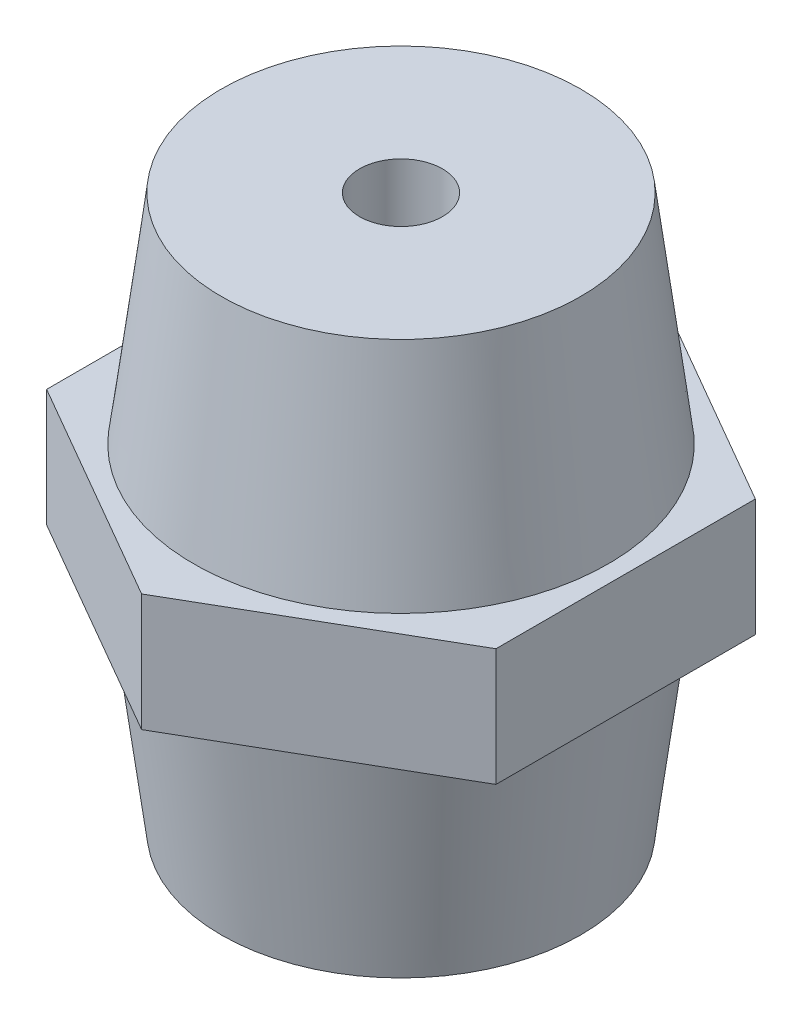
ISO-10303-21;
HEADER;
FILE_DESCRIPTION(('STEP AP214'),'2;1');
FILE_NAME('part.step','',(''),(''),'','','');
FILE_SCHEMA(('AUTOMOTIVE_DESIGN { 1 0 10303 214 1 1 1 1 }'));
ENDSEC;
DATA;
#1=APPLICATION_CONTEXT('core data for automotive mechanical design processes');
#2=APPLICATION_PROTOCOL_DEFINITION('international standard','automotive_design',2000,#1);
#3=PRODUCT_CONTEXT('',#1,'mechanical');
#4=PRODUCT('Part','Part','',(#3));
#5=PRODUCT_RELATED_PRODUCT_CATEGORY('part','',(#4));
#6=PRODUCT_DEFINITION_FORMATION('','',#4);
#7=PRODUCT_DEFINITION_CONTEXT('part definition',#1,'design');
#8=PRODUCT_DEFINITION('design','',#6,#7);
#9=PRODUCT_DEFINITION_SHAPE('','',#8);
#10=(LENGTH_UNIT() NAMED_UNIT(*) SI_UNIT(.MILLI.,.METRE.));
#11=(NAMED_UNIT(*) PLANE_ANGLE_UNIT() SI_UNIT($,.RADIAN.));
#12=(NAMED_UNIT(*) SI_UNIT($,.STERADIAN.) SOLID_ANGLE_UNIT());
#13=UNCERTAINTY_MEASURE_WITH_UNIT(LENGTH_MEASURE(1.E-05),#10,'distance_accuracy_value','');
#14=(GEOMETRIC_REPRESENTATION_CONTEXT(3) GLOBAL_UNCERTAINTY_ASSIGNED_CONTEXT((#13)) GLOBAL_UNIT_ASSIGNED_CONTEXT((#10,
#11,#12)) REPRESENTATION_CONTEXT('',''));
#15=CARTESIAN_POINT('',(0.,0.,0.));
#16=DIRECTION('',(0.,0.,1.));
#17=DIRECTION('',(1.,0.,0.));
#18=AXIS2_PLACEMENT_3D('',#15,#16,#17);
#19=CARTESIAN_POINT('',(26.,-40.,0.));
#20=DIRECTION('',(0.,1.,0.));
#21=DIRECTION('',(1.,0.,0.));
#22=AXIS2_PLACEMENT_3D('',#19,#20,#21);
#23=PLANE('',#22);
#24=CARTESIAN_POINT('',(0.,-40.,0.));
#25=DIRECTION('',(0.,1.,0.));
#26=DIRECTION('',(0.,0.,1.));
#27=AXIS2_PLACEMENT_3D('',#24,#25,#26);
#28=CIRCLE('',#27,6.);
#29=CARTESIAN_POINT('',(0.,-40.,6.));
#30=VERTEX_POINT('',#29);
#31=EDGE_CURVE('E184',#30,#30,#28,.T.);
#32=ORIENTED_EDGE('',*,*,#31,.T.);
#33=EDGE_LOOP('',(#32));
#34=FACE_BOUND('',#33,.T.);
#35=CARTESIAN_POINT('',(0.,-40.,0.));
#36=DIRECTION('',(0.,1.,0.));
#37=DIRECTION('',(0.,0.,1.));
#38=AXIS2_PLACEMENT_3D('',#35,#36,#37);
#39=CIRCLE('',#38,26.);
#40=CARTESIAN_POINT('',(0.,-40.,-26.));
#41=VERTEX_POINT('',#40);
#42=EDGE_CURVE('E185',#41,#41,#39,.T.);
#43=ORIENTED_EDGE('',*,*,#42,.F.);
#44=EDGE_LOOP('',(#43));
#45=FACE_BOUND('',#44,.T.);
#46=ADVANCED_FACE('F15',(#34,#45),#23,.F.);
#47=CARTESIAN_POINT('',(6.,-26.,0.));
#48=DIRECTION('',(0.,1.,0.));
#49=DIRECTION('',(1.,0.,0.));
#50=AXIS2_PLACEMENT_3D('',#47,#48,#49);
#51=PLANE('',#50);
#52=CARTESIAN_POINT('',(0.,-26.,0.));
#53=DIRECTION('',(0.,1.,0.));
#54=DIRECTION('',(0.,0.,1.));
#55=AXIS2_PLACEMENT_3D('',#52,#53,#54);
#56=CIRCLE('',#55,6.);
#57=CARTESIAN_POINT('',(0.,-26.,6.));
#58=VERTEX_POINT('',#57);
#59=EDGE_CURVE('E156',#58,#58,#56,.T.);
#60=ORIENTED_EDGE('',*,*,#59,.F.);
#61=EDGE_LOOP('',(#60));
#62=FACE_BOUND('',#61,.T.);
#63=ADVANCED_FACE('F17',(#62),#51,.F.);
#64=CARTESIAN_POINT('',(-32.5,8.5,18.7638837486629));
#65=DIRECTION('',(0.5,0.,-0.866025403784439));
#66=DIRECTION('',(0.,-1.,0.));
#67=AXIS2_PLACEMENT_3D('',#64,#65,#66);
#68=PLANE('',#67);
#69=DIRECTION('',(0.866025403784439,0.,0.5));
#70=VECTOR('',#69,1.);
#71=CARTESIAN_POINT('',(-32.5,-8.5,18.7638837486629));
#72=LINE('',#71,#70);
#73=CARTESIAN_POINT('',(-32.5,-8.5,18.7638837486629));
#74=VERTEX_POINT('',#73);
#75=CARTESIAN_POINT('',(0.,-8.5,37.5277674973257));
#76=VERTEX_POINT('',#75);
#77=EDGE_CURVE('E124',#74,#76,#72,.T.);
#78=ORIENTED_EDGE('',*,*,#77,.T.);
#79=DIRECTION('',(0.,-1.,0.));
#80=VECTOR('',#79,1.);
#81=CARTESIAN_POINT('',(0.,8.5,37.5277674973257));
#82=LINE('',#81,#80);
#83=CARTESIAN_POINT('',(0.,8.5,37.5277674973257));
#84=VERTEX_POINT('',#83);
#85=EDGE_CURVE('E157',#84,#76,#82,.T.);
#86=ORIENTED_EDGE('',*,*,#85,.F.);
#87=DIRECTION('',(0.866025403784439,0.,0.5));
#88=VECTOR('',#87,1.);
#89=CARTESIAN_POINT('',(-32.5,8.5,18.7638837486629));
#90=LINE('',#89,#88);
#91=CARTESIAN_POINT('',(-32.5,8.5,18.7638837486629));
#92=VERTEX_POINT('',#91);
#93=EDGE_CURVE('E127',#92,#84,#90,.T.);
#94=ORIENTED_EDGE('',*,*,#93,.F.);
#95=DIRECTION('',(0.,-1.,0.));
#96=VECTOR('',#95,1.);
#97=CARTESIAN_POINT('',(-32.5,8.5,18.7638837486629));
#98=LINE('',#97,#96);
#99=EDGE_CURVE('E9',#92,#74,#98,.T.);
#100=ORIENTED_EDGE('',*,*,#99,.T.);
#101=EDGE_LOOP('',(#78,#86,#94,#100));
#102=FACE_BOUND('',#101,.T.);
#103=ADVANCED_FACE('F122',(#102),#68,.F.);
#104=CARTESIAN_POINT('',(-32.5,8.5,-18.7638837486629));
#105=DIRECTION('',(1.,0.,0.));
#106=DIRECTION('',(0.,0.,-1.));
#107=AXIS2_PLACEMENT_3D('',#104,#105,#106);
#108=PLANE('',#107);
#109=DIRECTION('',(0.,0.,1.));
#110=VECTOR('',#109,1.);
#111=CARTESIAN_POINT('',(-32.5,-8.5,-18.7638837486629));
#112=LINE('',#111,#110);
#113=CARTESIAN_POINT('',(-32.5,-8.5,-18.7638837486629));
#114=VERTEX_POINT('',#113);
#115=EDGE_CURVE('E132',#114,#74,#112,.T.);
#116=ORIENTED_EDGE('',*,*,#115,.T.);
#117=ORIENTED_EDGE('',*,*,#99,.F.);
#118=DIRECTION('',(0.,0.,1.));
#119=VECTOR('',#118,1.);
#120=CARTESIAN_POINT('',(-32.5,8.5,-18.7638837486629));
#121=LINE('',#120,#119);
#122=CARTESIAN_POINT('',(-32.5,8.5,-18.7638837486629));
#123=VERTEX_POINT('',#122);
#124=EDGE_CURVE('E174',#123,#92,#121,.T.);
#125=ORIENTED_EDGE('',*,*,#124,.F.);
#126=DIRECTION('',(0.,-1.,0.));
#127=VECTOR('',#126,1.);
#128=CARTESIAN_POINT('',(-32.5,8.5,-18.7638837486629));
#129=LINE('',#128,#127);
#130=EDGE_CURVE('E26',#123,#114,#129,.T.);
#131=ORIENTED_EDGE('',*,*,#130,.T.);
#132=EDGE_LOOP('',(#116,#117,#125,#131));
#133=FACE_BOUND('',#132,.T.);
#134=ADVANCED_FACE('F133',(#133),#108,.F.);
#135=CARTESIAN_POINT('',(0.,8.5,-37.5277674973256));
#136=DIRECTION('',(0.5,0.,0.866025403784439));
#137=DIRECTION('',(0.,-1.,0.));
#138=AXIS2_PLACEMENT_3D('',#135,#136,#137);
#139=PLANE('',#138);
#140=DIRECTION('',(-0.866025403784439,0.,0.5));
#141=VECTOR('',#140,1.);
#142=CARTESIAN_POINT('',(0.,-8.5,-37.5277674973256));
#143=LINE('',#142,#141);
#144=CARTESIAN_POINT('',(0.,-8.5,-37.5277674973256));
#145=VERTEX_POINT('',#144);
#146=EDGE_CURVE('E138',#145,#114,#143,.T.);
#147=ORIENTED_EDGE('',*,*,#146,.T.);
#148=ORIENTED_EDGE('',*,*,#130,.F.);
#149=DIRECTION('',(-0.866025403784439,0.,0.5));
#150=VECTOR('',#149,1.);
#151=CARTESIAN_POINT('',(0.,8.5,-37.5277674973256));
#152=LINE('',#151,#150);
#153=CARTESIAN_POINT('',(0.,8.5,-37.5277674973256));
#154=VERTEX_POINT('',#153);
#155=EDGE_CURVE('E166',#154,#123,#152,.T.);
#156=ORIENTED_EDGE('',*,*,#155,.F.);
#157=DIRECTION('',(0.,-1.,0.));
#158=VECTOR('',#157,1.);
#159=CARTESIAN_POINT('',(0.,8.5,-37.5277674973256));
#160=LINE('',#159,#158);
#161=EDGE_CURVE('E194',#154,#145,#160,.T.);
#162=ORIENTED_EDGE('',*,*,#161,.T.);
#163=EDGE_LOOP('',(#147,#148,#156,#162));
#164=FACE_BOUND('',#163,.T.);
#165=ADVANCED_FACE('F255',(#164),#139,.F.);
#166=CARTESIAN_POINT('',(32.5,8.5,-18.7638837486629));
#167=DIRECTION('',(-0.5,0.,0.866025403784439));
#168=DIRECTION('',(0.,1.,0.));
#169=AXIS2_PLACEMENT_3D('',#166,#167,#168);
#170=PLANE('',#169);
#171=DIRECTION('',(-0.866025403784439,0.,-0.5));
#172=VECTOR('',#171,1.);
#173=CARTESIAN_POINT('',(32.5,-8.5,-18.7638837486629));
#174=LINE('',#173,#172);
#175=CARTESIAN_POINT('',(32.5,-8.5,-18.7638837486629));
#176=VERTEX_POINT('',#175);
#177=EDGE_CURVE('E178',#176,#145,#174,.T.);
#178=ORIENTED_EDGE('',*,*,#177,.T.);
#179=ORIENTED_EDGE('',*,*,#161,.F.);
#180=DIRECTION('',(-0.866025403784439,0.,-0.5));
#181=VECTOR('',#180,1.);
#182=CARTESIAN_POINT('',(32.5,8.5,-18.7638837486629));
#183=LINE('',#182,#181);
#184=CARTESIAN_POINT('',(32.5,8.5,-18.7638837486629));
#185=VERTEX_POINT('',#184);
#186=EDGE_CURVE('E162',#185,#154,#183,.T.);
#187=ORIENTED_EDGE('',*,*,#186,.F.);
#188=DIRECTION('',(0.,-1.,0.));
#189=VECTOR('',#188,1.);
#190=CARTESIAN_POINT('',(32.5,8.5,-18.7638837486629));
#191=LINE('',#190,#189);
#192=EDGE_CURVE('E40',#185,#176,#191,.T.);
#193=ORIENTED_EDGE('',*,*,#192,.T.);
#194=EDGE_LOOP('',(#178,#179,#187,#193));
#195=FACE_BOUND('',#194,.T.);
#196=ADVANCED_FACE('F258',(#195),#170,.F.);
#197=CARTESIAN_POINT('',(32.5,8.5,18.7638837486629));
#198=DIRECTION('',(-1.,0.,0.));
#199=DIRECTION('',(0.,1.,0.));
#200=AXIS2_PLACEMENT_3D('',#197,#198,#199);
#201=PLANE('',#200);
#202=DIRECTION('',(0.,0.,-1.));
#203=VECTOR('',#202,1.);
#204=CARTESIAN_POINT('',(32.5,-8.5,18.7638837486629));
#205=LINE('',#204,#203);
#206=CARTESIAN_POINT('',(32.5,-8.5,18.7638837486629));
#207=VERTEX_POINT('',#206);
#208=EDGE_CURVE('E175',#207,#176,#205,.T.);
#209=ORIENTED_EDGE('',*,*,#208,.T.);
#210=ORIENTED_EDGE('',*,*,#192,.F.);
#211=DIRECTION('',(0.,0.,-1.));
#212=VECTOR('',#211,1.);
#213=CARTESIAN_POINT('',(32.5,8.5,18.7638837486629));
#214=LINE('',#213,#212);
#215=CARTESIAN_POINT('',(32.5,8.5,18.7638837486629));
#216=VERTEX_POINT('',#215);
#217=EDGE_CURVE('E167',#216,#185,#214,.T.);
#218=ORIENTED_EDGE('',*,*,#217,.F.);
#219=DIRECTION('',(0.,-1.,0.));
#220=VECTOR('',#219,1.);
#221=CARTESIAN_POINT('',(32.5,8.5,18.7638837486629));
#222=LINE('',#221,#220);
#223=EDGE_CURVE('E161',#216,#207,#222,.T.);
#224=ORIENTED_EDGE('',*,*,#223,.T.);
#225=EDGE_LOOP('',(#209,#210,#218,#224));
#226=FACE_BOUND('',#225,.T.);
#227=ADVANCED_FACE('F211',(#226),#201,.F.);
#228=CARTESIAN_POINT('',(0.,8.5,37.5277674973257));
#229=DIRECTION('',(-0.5,0.,-0.866025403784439));
#230=DIRECTION('',(-0.866025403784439,0.,0.5));
#231=AXIS2_PLACEMENT_3D('',#228,#229,#230);
#232=PLANE('',#231);
#233=DIRECTION('',(0.866025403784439,0.,-0.5));
#234=VECTOR('',#233,1.);
#235=CARTESIAN_POINT('',(0.,-8.5,37.5277674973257));
#236=LINE('',#235,#234);
#237=EDGE_CURVE('E143',#76,#207,#236,.T.);
#238=ORIENTED_EDGE('',*,*,#237,.T.);
#239=ORIENTED_EDGE('',*,*,#223,.F.);
#240=DIRECTION('',(0.866025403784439,0.,-0.5));
#241=VECTOR('',#240,1.);
#242=CARTESIAN_POINT('',(0.,8.5,37.5277674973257));
#243=LINE('',#242,#241);
#244=EDGE_CURVE('E188',#84,#216,#243,.T.);
#245=ORIENTED_EDGE('',*,*,#244,.F.);
#246=ORIENTED_EDGE('',*,*,#85,.T.);
#247=EDGE_LOOP('',(#238,#239,#245,#246));
#248=FACE_BOUND('',#247,.T.);
#249=ADVANCED_FACE('F218',(#248),#232,.F.);
#250=CARTESIAN_POINT('',(32.5,-8.5,18.7638837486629));
#251=DIRECTION('',(0.,1.,0.));
#252=DIRECTION('',(1.,0.,0.));
#253=AXIS2_PLACEMENT_3D('',#250,#251,#252);
#254=PLANE('',#253);
#255=CARTESIAN_POINT('',(0.,-8.5,0.));
#256=DIRECTION('',(0.,1.,0.));
#257=DIRECTION('',(0.,0.,1.));
#258=AXIS2_PLACEMENT_3D('',#255,#256,#257);
#259=CIRCLE('',#258,30.);
#260=CARTESIAN_POINT('',(0.,-8.5,30.));
#261=VERTEX_POINT('',#260);
#262=EDGE_CURVE('E181',#261,#261,#259,.T.);
#263=ORIENTED_EDGE('',*,*,#262,.T.);
#264=EDGE_LOOP('',(#263));
#265=FACE_BOUND('',#264,.T.);
#266=ORIENTED_EDGE('',*,*,#237,.F.);
#267=ORIENTED_EDGE('',*,*,#77,.F.);
#268=ORIENTED_EDGE('',*,*,#115,.F.);
#269=ORIENTED_EDGE('',*,*,#146,.F.);
#270=ORIENTED_EDGE('',*,*,#177,.F.);
#271=ORIENTED_EDGE('',*,*,#208,.F.);
#272=EDGE_LOOP('',(#266,#267,#268,#269,#270,#271));
#273=FACE_BOUND('',#272,.T.);
#274=ADVANCED_FACE('F140',(#265,#273),#254,.F.);
#275=CARTESIAN_POINT('',(32.5,8.5,18.7638837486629));
#276=DIRECTION('',(0.,1.,0.));
#277=DIRECTION('',(1.,0.,0.));
#278=AXIS2_PLACEMENT_3D('',#275,#276,#277);
#279=PLANE('',#278);
#280=CARTESIAN_POINT('',(0.,8.5,0.));
#281=DIRECTION('',(0.,1.,0.));
#282=DIRECTION('',(0.,0.,1.));
#283=AXIS2_PLACEMENT_3D('',#280,#281,#282);
#284=CIRCLE('',#283,30.);
#285=CARTESIAN_POINT('',(0.,8.5,-30.));
#286=VERTEX_POINT('',#285);
#287=EDGE_CURVE('E19',#286,#286,#284,.T.);
#288=ORIENTED_EDGE('',*,*,#287,.F.);
#289=EDGE_LOOP('',(#288));
#290=FACE_BOUND('',#289,.T.);
#291=ORIENTED_EDGE('',*,*,#244,.T.);
#292=ORIENTED_EDGE('',*,*,#217,.T.);
#293=ORIENTED_EDGE('',*,*,#186,.T.);
#294=ORIENTED_EDGE('',*,*,#155,.T.);
#295=ORIENTED_EDGE('',*,*,#124,.T.);
#296=ORIENTED_EDGE('',*,*,#93,.T.);
#297=EDGE_LOOP('',(#291,#292,#293,#294,#295,#296));
#298=FACE_BOUND('',#297,.T.);
#299=ADVANCED_FACE('F207',(#290,#298),#279,.T.);
#300=CARTESIAN_POINT('',(6.,40.,0.));
#301=DIRECTION('',(0.,-1.,0.));
#302=DIRECTION('',(0.,0.,-1.));
#303=AXIS2_PLACEMENT_3D('',#300,#301,#302);
#304=PLANE('',#303);
#305=CARTESIAN_POINT('',(0.,40.,0.));
#306=DIRECTION('',(0.,1.,0.));
#307=DIRECTION('',(0.,0.,1.));
#308=AXIS2_PLACEMENT_3D('',#305,#306,#307);
#309=CIRCLE('',#308,6.);
#310=CARTESIAN_POINT('',(0.,40.,6.));
#311=VERTEX_POINT('',#310);
#312=EDGE_CURVE('E171',#311,#311,#309,.T.);
#313=ORIENTED_EDGE('',*,*,#312,.F.);
#314=EDGE_LOOP('',(#313));
#315=FACE_BOUND('',#314,.T.);
#316=CARTESIAN_POINT('',(0.,40.,0.));
#317=DIRECTION('',(0.,1.,0.));
#318=DIRECTION('',(0.,0.,1.));
#319=AXIS2_PLACEMENT_3D('',#316,#317,#318);
#320=CIRCLE('',#319,26.);
#321=CARTESIAN_POINT('',(0.,40.,-26.));
#322=VERTEX_POINT('',#321);
#323=EDGE_CURVE('E68',#322,#322,#320,.T.);
#324=ORIENTED_EDGE('',*,*,#323,.T.);
#325=EDGE_LOOP('',(#324));
#326=FACE_BOUND('',#325,.T.);
#327=ADVANCED_FACE('F310',(#315,#326),#304,.F.);
#328=CARTESIAN_POINT('',(0.,26.,0.));
#329=DIRECTION('',(0.,-1.,0.));
#330=DIRECTION('',(0.,0.,-1.));
#331=AXIS2_PLACEMENT_3D('',#328,#329,#330);
#332=PLANE('',#331);
#333=CARTESIAN_POINT('',(0.,26.,0.));
#334=DIRECTION('',(0.,1.,0.));
#335=DIRECTION('',(0.,0.,1.));
#336=AXIS2_PLACEMENT_3D('',#333,#334,#335);
#337=CIRCLE('',#336,6.);
#338=CARTESIAN_POINT('',(0.,26.,6.));
#339=VERTEX_POINT('',#338);
#340=EDGE_CURVE('E168',#339,#339,#337,.T.);
#341=ORIENTED_EDGE('',*,*,#340,.T.);
#342=EDGE_LOOP('',(#341));
#343=FACE_BOUND('',#342,.T.);
#344=ADVANCED_FACE('F317',(#343),#332,.F.);
#345=CARTESIAN_POINT('',(0.,26.,0.));
#346=DIRECTION('',(0.,1.,0.));
#347=DIRECTION('',(0.,0.,1.));
#348=AXIS2_PLACEMENT_3D('',#345,#346,#347);
#349=CYLINDRICAL_SURFACE('',#348,6.);
#350=ORIENTED_EDGE('',*,*,#312,.T.);
#351=EDGE_LOOP('',(#350));
#352=FACE_BOUND('',#351,.T.);
#353=ORIENTED_EDGE('',*,*,#340,.F.);
#354=EDGE_LOOP('',(#353));
#355=FACE_BOUND('',#354,.T.);
#356=ADVANCED_FACE('F265',(#352,#355),#349,.F.);
#357=CARTESIAN_POINT('',(0.,8.5,0.));
#358=DIRECTION('',(0.,-1.,0.));
#359=DIRECTION('',(0.,0.,-1.));
#360=AXIS2_PLACEMENT_3D('',#357,#358,#359);
#361=CONICAL_SURFACE('',#360,30.,0.126308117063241);
#362=ORIENTED_EDGE('',*,*,#287,.T.);
#363=EDGE_LOOP('',(#362));
#364=FACE_BOUND('',#363,.T.);
#365=ORIENTED_EDGE('',*,*,#323,.F.);
#366=EDGE_LOOP('',(#365));
#367=FACE_BOUND('',#366,.T.);
#368=ADVANCED_FACE('F261',(#364,#367),#361,.T.);
#369=CARTESIAN_POINT('',(0.,26.,0.));
#370=DIRECTION('',(0.,1.,0.));
#371=DIRECTION('',(0.,0.,1.));
#372=AXIS2_PLACEMENT_3D('',#369,#370,#371);
#373=CYLINDRICAL_SURFACE('',#372,6.);
#374=ORIENTED_EDGE('',*,*,#59,.T.);
#375=EDGE_LOOP('',(#374));
#376=FACE_BOUND('',#375,.T.);
#377=ORIENTED_EDGE('',*,*,#31,.F.);
#378=EDGE_LOOP('',(#377));
#379=FACE_BOUND('',#378,.T.);
#380=ADVANCED_FACE('F251',(#376,#379),#373,.F.);
#381=CARTESIAN_POINT('',(0.,-40.,0.));
#382=DIRECTION('',(0.,1.,0.));
#383=DIRECTION('',(0.,0.,1.));
#384=AXIS2_PLACEMENT_3D('',#381,#382,#383);
#385=CONICAL_SURFACE('',#384,26.,0.126308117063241);
#386=ORIENTED_EDGE('',*,*,#262,.F.);
#387=EDGE_LOOP('',(#386));
#388=FACE_BOUND('',#387,.T.);
#389=ORIENTED_EDGE('',*,*,#42,.T.);
#390=EDGE_LOOP('',(#389));
#391=FACE_BOUND('',#390,.T.);
#392=ADVANCED_FACE('F236',(#388,#391),#385,.T.);
#393=CLOSED_SHELL('',(#46,#63,#103,#134,#165,#196,#227,#249,#274,#299,#327,#344,#356,#368,#380,#392));
#394=MANIFOLD_SOLID_BREP('B1',#393);
#395=ADVANCED_BREP_SHAPE_REPRESENTATION('',(#18,#394),#14);
#396=SHAPE_DEFINITION_REPRESENTATION(#9,#395);
ENDSEC;
END-ISO-10303-21;
